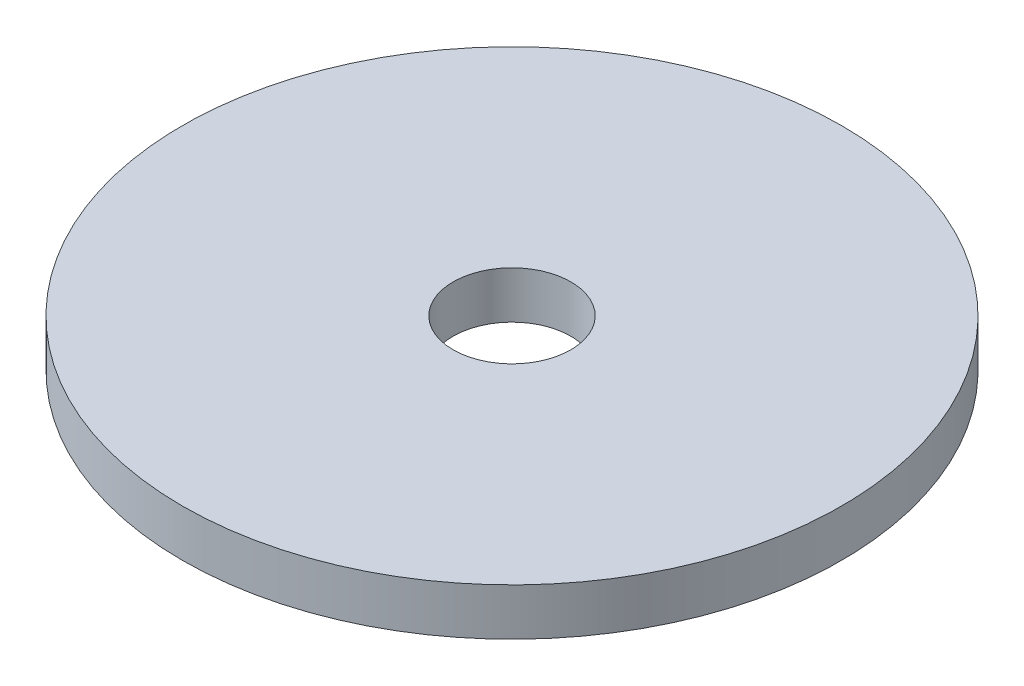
from build123d import *

# Parameters (mm, degrees)
SKETCH1_W = 11.5
SKETCH1_H = 2


with BuildPart() as part:
    # Sketch1 → Revolve1 (revolve)
    with BuildSketch(Plane.XY, mode=Mode.PRIVATE) as revolve1_sk:
        with Locations((8.25, 1)):
            Rectangle(SKETCH1_W, SKETCH1_H)
    revolve(revolve1_sk.sketch.rotate(Axis((0, 0, 0), (0, -1, 0)), 90), axis=Axis((0, 0, 0), (0, -1, 0)))


solid = part.part
